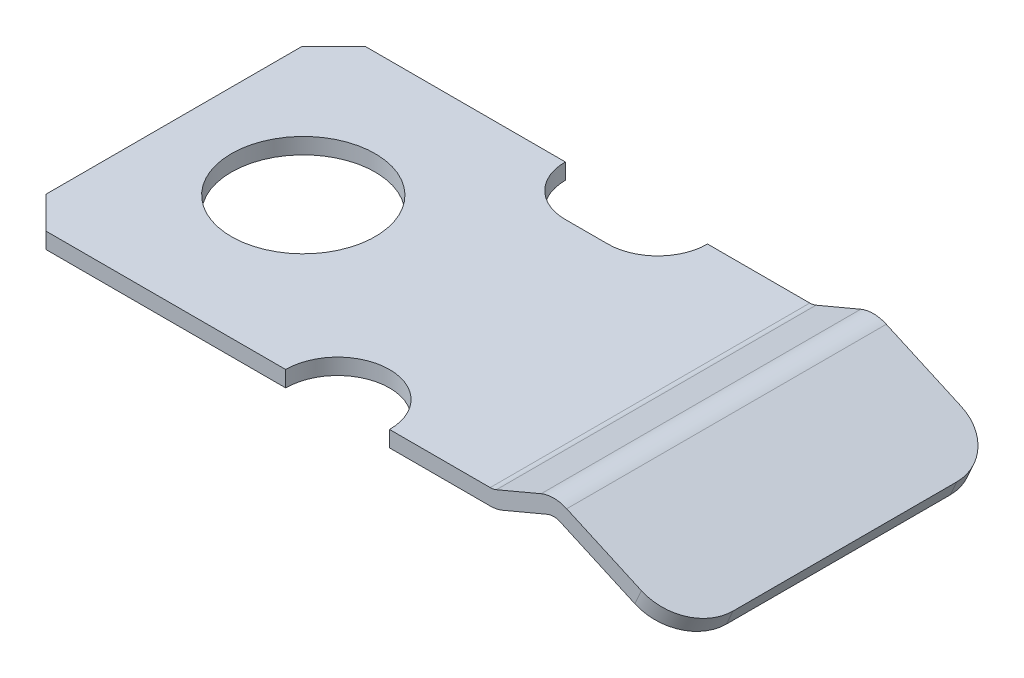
ISO-10303-21;
HEADER;
FILE_DESCRIPTION(('STEP AP214'),'2;1');
FILE_NAME('part.step','',(''),(''),'','','');
FILE_SCHEMA(('AUTOMOTIVE_DESIGN { 1 0 10303 214 1 1 1 1 }'));
ENDSEC;
DATA;
#1=APPLICATION_CONTEXT('core data for automotive mechanical design processes');
#2=APPLICATION_PROTOCOL_DEFINITION('international standard','automotive_design',2000,#1);
#3=PRODUCT_CONTEXT('',#1,'mechanical');
#4=PRODUCT('Part','Part','',(#3));
#5=PRODUCT_RELATED_PRODUCT_CATEGORY('part','',(#4));
#6=PRODUCT_DEFINITION_FORMATION('','',#4);
#7=PRODUCT_DEFINITION_CONTEXT('part definition',#1,'design');
#8=PRODUCT_DEFINITION('design','',#6,#7);
#9=PRODUCT_DEFINITION_SHAPE('','',#8);
#10=(LENGTH_UNIT() NAMED_UNIT(*) SI_UNIT(.MILLI.,.METRE.));
#11=(NAMED_UNIT(*) PLANE_ANGLE_UNIT() SI_UNIT($,.RADIAN.));
#12=(NAMED_UNIT(*) SI_UNIT($,.STERADIAN.) SOLID_ANGLE_UNIT());
#13=UNCERTAINTY_MEASURE_WITH_UNIT(LENGTH_MEASURE(1.E-05),#10,'distance_accuracy_value','');
#14=(GEOMETRIC_REPRESENTATION_CONTEXT(3) GLOBAL_UNCERTAINTY_ASSIGNED_CONTEXT((#13)) GLOBAL_UNIT_ASSIGNED_CONTEXT((#10,
#11,#12)) REPRESENTATION_CONTEXT('',''));
#15=CARTESIAN_POINT('',(0.,0.,0.));
#16=DIRECTION('',(0.,0.,1.));
#17=DIRECTION('',(1.,0.,0.));
#18=AXIS2_PLACEMENT_3D('',#15,#16,#17);
#19=CARTESIAN_POINT('',(14.8987900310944,1.,-5.));
#20=DIRECTION('',(0.,0.,1.));
#21=DIRECTION('',(1.,0.,0.));
#22=AXIS2_PLACEMENT_3D('',#19,#20,#21);
#23=PLANE('',#22);
#24=DIRECTION('',(-0.912195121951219,0.409756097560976,0.));
#25=VECTOR('',#24,1.);
#26=CARTESIAN_POINT('',(21.,-0.543902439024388,-5.));
#27=LINE('',#26,#25);
#28=CARTESIAN_POINT('',(19.6317073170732,0.0707317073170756,-5.));
#29=VERTEX_POINT('',#28);
#30=CARTESIAN_POINT('',(17.2924742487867,1.12151019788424,-5.));
#31=VERTEX_POINT('',#30);
#32=EDGE_CURVE('E321',#29,#31,#27,.T.);
#33=ORIENTED_EDGE('',*,*,#32,.F.);
#34=DIRECTION('',(0.409756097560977,0.912195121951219,0.));
#35=VECTOR('',#34,1.);
#36=CARTESIAN_POINT('',(19.1843898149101,-0.925082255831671,-5.));
#37=LINE('',#36,#35);
#38=CARTESIAN_POINT('',(19.4268292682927,-0.385365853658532,-5.));
#39=VERTEX_POINT('',#38);
#40=EDGE_CURVE('E54',#29,#39,#37,.F.);
#41=ORIENTED_EDGE('',*,*,#40,.T.);
#42=DIRECTION('',(0.912195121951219,-0.409756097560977,0.));
#43=VECTOR('',#42,1.);
#44=CARTESIAN_POINT('',(17.0875962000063,0.665412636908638,-5.));
#45=LINE('',#44,#43);
#46=CARTESIAN_POINT('',(17.0875962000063,0.665412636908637,-5.));
#47=VERTEX_POINT('',#46);
#48=EDGE_CURVE('E310',#47,#39,#45,.T.);
#49=ORIENTED_EDGE('',*,*,#48,.F.);
#50=CARTESIAN_POINT('',(16.8827181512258,0.209315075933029,-5.));
#51=DIRECTION('',(0.,0.,-1.));
#52=DIRECTION('',(-1.,0.,0.));
#53=AXIS2_PLACEMENT_3D('',#50,#51,#52);
#54=CIRCLE('',#53,0.5);
#55=CARTESIAN_POINT('',(16.688265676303,0.669954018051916,-5.));
#56=VERTEX_POINT('',#55);
#57=EDGE_CURVE('E328',#56,#47,#54,.T.);
#58=ORIENTED_EDGE('',*,*,#57,.F.);
#59=DIRECTION('',(0.921277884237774,0.388904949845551,0.));
#60=VECTOR('',#59,1.);
#61=CARTESIAN_POINT('',(15.2876949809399,0.0787221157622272,-5.));
#62=LINE('',#61,#60);
#63=CARTESIAN_POINT('',(15.2876949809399,0.0787221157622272,-5.));
#64=VERTEX_POINT('',#63);
#65=EDGE_CURVE('E352',#64,#56,#62,.T.);
#66=ORIENTED_EDGE('',*,*,#65,.F.);
#67=CARTESIAN_POINT('',(14.8987900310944,1.,-5.));
#68=DIRECTION('',(0.,0.,1.));
#69=DIRECTION('',(1.,0.,0.));
#70=AXIS2_PLACEMENT_3D('',#67,#68,#69);
#71=CIRCLE('',#70,1.);
#72=CARTESIAN_POINT('',(14.8987900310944,0.,-5.));
#73=VERTEX_POINT('',#72);
#74=EDGE_CURVE('E353',#73,#64,#71,.T.);
#75=ORIENTED_EDGE('',*,*,#74,.F.);
#76=DIRECTION('',(1.,0.,0.));
#77=VECTOR('',#76,1.);
#78=CARTESIAN_POINT('',(0.,0.,-5.));
#79=LINE('',#78,#77);
#80=CARTESIAN_POINT('',(11.7,0.,-5.));
#81=VERTEX_POINT('',#80);
#82=EDGE_CURVE('E201',#81,#73,#79,.T.);
#83=ORIENTED_EDGE('',*,*,#82,.F.);
#84=DIRECTION('',(0.,1.,0.));
#85=VECTOR('',#84,1.);
#86=CARTESIAN_POINT('',(11.7,-9.5,-5.));
#87=LINE('',#86,#85);
#88=CARTESIAN_POINT('',(11.7,0.5,-5.));
#89=VERTEX_POINT('',#88);
#90=EDGE_CURVE('E186',#81,#89,#87,.T.);
#91=ORIENTED_EDGE('',*,*,#90,.T.);
#92=DIRECTION('',(-1.,0.,0.));
#93=VECTOR('',#92,1.);
#94=CARTESIAN_POINT('',(0.,0.5,-5.));
#95=LINE('',#94,#93);
#96=CARTESIAN_POINT('',(14.8987900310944,0.499999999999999,-5.));
#97=VERTEX_POINT('',#96);
#98=EDGE_CURVE('E199',#97,#89,#95,.T.);
#99=ORIENTED_EDGE('',*,*,#98,.F.);
#100=CARTESIAN_POINT('',(14.8987900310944,1.,-5.));
#101=DIRECTION('',(0.,0.,-1.));
#102=DIRECTION('',(1.,0.,0.));
#103=AXIS2_PLACEMENT_3D('',#100,#101,#102);
#104=CIRCLE('',#103,0.500000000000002);
#105=CARTESIAN_POINT('',(15.0932425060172,0.539361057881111,-5.));
#106=VERTEX_POINT('',#105);
#107=EDGE_CURVE('E216',#106,#97,#104,.T.);
#108=ORIENTED_EDGE('',*,*,#107,.F.);
#109=DIRECTION('',(-0.921277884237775,-0.388904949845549,0.));
#110=VECTOR('',#109,1.);
#111=CARTESIAN_POINT('',(16.4938132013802,1.1305929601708,-5.));
#112=LINE('',#111,#110);
#113=CARTESIAN_POINT('',(16.4938132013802,1.1305929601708,-5.));
#114=VERTEX_POINT('',#113);
#115=EDGE_CURVE('E326',#114,#106,#112,.T.);
#116=ORIENTED_EDGE('',*,*,#115,.F.);
#117=CARTESIAN_POINT('',(16.8827181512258,0.209315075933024,-5.));
#118=DIRECTION('',(0.,0.,1.));
#119=DIRECTION('',(-1.,0.,0.));
#120=AXIS2_PLACEMENT_3D('',#117,#118,#119);
#121=CIRCLE('',#120,1.);
#122=EDGE_CURVE('E324',#31,#114,#121,.T.);
#123=ORIENTED_EDGE('',*,*,#122,.F.);
#124=EDGE_LOOP('',(#33,#41,#49,#58,#66,#75,#83,#91,#99,#108,#116,#123));
#125=FACE_BOUND('',#124,.T.);
#126=ADVANCED_FACE('F31',(#125),#23,.F.);
#127=CARTESIAN_POINT('',(14.8987900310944,1.,5.));
#128=DIRECTION('',(0.,0.,1.));
#129=DIRECTION('',(1.,0.,0.));
#130=AXIS2_PLACEMENT_3D('',#127,#128,#129);
#131=PLANE('',#130);
#132=DIRECTION('',(0.912195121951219,-0.409756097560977,0.));
#133=VECTOR('',#132,1.);
#134=CARTESIAN_POINT('',(17.0875962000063,0.665412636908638,5.));
#135=LINE('',#134,#133);
#136=CARTESIAN_POINT('',(17.0875962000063,0.665412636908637,5.));
#137=VERTEX_POINT('',#136);
#138=CARTESIAN_POINT('',(19.4268292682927,-0.385365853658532,5.));
#139=VERTEX_POINT('',#138);
#140=EDGE_CURVE('E226',#137,#139,#135,.T.);
#141=ORIENTED_EDGE('',*,*,#140,.T.);
#142=DIRECTION('',(0.409756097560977,0.912195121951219,0.));
#143=VECTOR('',#142,1.);
#144=CARTESIAN_POINT('',(19.6317073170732,0.0707317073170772,5.));
#145=LINE('',#144,#143);
#146=CARTESIAN_POINT('',(19.6317073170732,0.0707317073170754,5.));
#147=VERTEX_POINT('',#146);
#148=EDGE_CURVE('E11',#139,#147,#145,.T.);
#149=ORIENTED_EDGE('',*,*,#148,.T.);
#150=DIRECTION('',(-0.912195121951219,0.409756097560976,0.));
#151=VECTOR('',#150,1.);
#152=CARTESIAN_POINT('',(21.,-0.543902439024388,5.));
#153=LINE('',#152,#151);
#154=CARTESIAN_POINT('',(17.2924742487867,1.12151019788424,5.));
#155=VERTEX_POINT('',#154);
#156=EDGE_CURVE('E228',#147,#155,#153,.T.);
#157=ORIENTED_EDGE('',*,*,#156,.T.);
#158=CARTESIAN_POINT('',(16.8827181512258,0.209315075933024,5.));
#159=DIRECTION('',(0.,0.,1.));
#160=DIRECTION('',(-1.,0.,0.));
#161=AXIS2_PLACEMENT_3D('',#158,#159,#160);
#162=CIRCLE('',#161,1.);
#163=CARTESIAN_POINT('',(16.4938132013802,1.1305929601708,5.));
#164=VERTEX_POINT('',#163);
#165=EDGE_CURVE('E230',#155,#164,#162,.T.);
#166=ORIENTED_EDGE('',*,*,#165,.T.);
#167=DIRECTION('',(-0.921277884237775,-0.388904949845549,0.));
#168=VECTOR('',#167,1.);
#169=CARTESIAN_POINT('',(16.4938132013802,1.1305929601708,5.));
#170=LINE('',#169,#168);
#171=CARTESIAN_POINT('',(15.0932425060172,0.539361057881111,5.));
#172=VERTEX_POINT('',#171);
#173=EDGE_CURVE('E232',#164,#172,#170,.T.);
#174=ORIENTED_EDGE('',*,*,#173,.T.);
#175=CARTESIAN_POINT('',(14.8987900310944,1.,5.));
#176=DIRECTION('',(0.,0.,-1.));
#177=DIRECTION('',(1.,0.,0.));
#178=AXIS2_PLACEMENT_3D('',#175,#176,#177);
#179=CIRCLE('',#178,0.500000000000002);
#180=CARTESIAN_POINT('',(14.8987900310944,0.499999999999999,5.));
#181=VERTEX_POINT('',#180);
#182=EDGE_CURVE('E234',#172,#181,#179,.T.);
#183=ORIENTED_EDGE('',*,*,#182,.T.);
#184=DIRECTION('',(-1.,0.,0.));
#185=VECTOR('',#184,1.);
#186=CARTESIAN_POINT('',(0.,0.5,5.));
#187=LINE('',#186,#185);
#188=CARTESIAN_POINT('',(11.75,0.5,5.));
#189=VERTEX_POINT('',#188);
#190=EDGE_CURVE('E237',#181,#189,#187,.T.);
#191=ORIENTED_EDGE('',*,*,#190,.T.);
#192=DIRECTION('',(0.,1.,0.));
#193=VECTOR('',#192,1.);
#194=CARTESIAN_POINT('',(11.75,-9.5,5.));
#195=LINE('',#194,#193);
#196=CARTESIAN_POINT('',(11.75,0.,5.));
#197=VERTEX_POINT('',#196);
#198=EDGE_CURVE('E277',#197,#189,#195,.T.);
#199=ORIENTED_EDGE('',*,*,#198,.F.);
#200=DIRECTION('',(1.,0.,0.));
#201=VECTOR('',#200,1.);
#202=CARTESIAN_POINT('',(0.,0.,5.));
#203=LINE('',#202,#201);
#204=CARTESIAN_POINT('',(14.8987900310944,0.,5.));
#205=VERTEX_POINT('',#204);
#206=EDGE_CURVE('E211',#197,#205,#203,.T.);
#207=ORIENTED_EDGE('',*,*,#206,.T.);
#208=CARTESIAN_POINT('',(14.8987900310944,1.,5.));
#209=DIRECTION('',(0.,0.,1.));
#210=DIRECTION('',(1.,0.,0.));
#211=AXIS2_PLACEMENT_3D('',#208,#209,#210);
#212=CIRCLE('',#211,1.);
#213=CARTESIAN_POINT('',(15.2876949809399,0.0787221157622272,5.));
#214=VERTEX_POINT('',#213);
#215=EDGE_CURVE('E220',#205,#214,#212,.T.);
#216=ORIENTED_EDGE('',*,*,#215,.T.);
#217=DIRECTION('',(0.921277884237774,0.388904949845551,0.));
#218=VECTOR('',#217,1.);
#219=CARTESIAN_POINT('',(15.2876949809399,0.0787221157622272,5.));
#220=LINE('',#219,#218);
#221=CARTESIAN_POINT('',(16.688265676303,0.669954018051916,5.));
#222=VERTEX_POINT('',#221);
#223=EDGE_CURVE('E222',#214,#222,#220,.T.);
#224=ORIENTED_EDGE('',*,*,#223,.T.);
#225=CARTESIAN_POINT('',(16.8827181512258,0.209315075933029,5.));
#226=DIRECTION('',(0.,0.,-1.));
#227=DIRECTION('',(-1.,0.,0.));
#228=AXIS2_PLACEMENT_3D('',#225,#226,#227);
#229=CIRCLE('',#228,0.5);
#230=EDGE_CURVE('E224',#222,#137,#229,.T.);
#231=ORIENTED_EDGE('',*,*,#230,.T.);
#232=EDGE_LOOP('',(#141,#149,#157,#166,#174,#183,#191,#199,#207,#216,#224,#231));
#233=FACE_BOUND('',#232,.T.);
#234=ADVANCED_FACE('F340',(#233),#131,.T.);
#235=CARTESIAN_POINT('',(0.,0.,5.));
#236=DIRECTION('',(1.,0.,0.));
#237=DIRECTION('',(0.,0.,-1.));
#238=AXIS2_PLACEMENT_3D('',#235,#236,#237);
#239=PLANE('',#238);
#240=DIRECTION('',(0.,0.,-1.));
#241=VECTOR('',#240,1.);
#242=CARTESIAN_POINT('',(0.,0.5,5.));
#243=LINE('',#242,#241);
#244=CARTESIAN_POINT('',(0.,0.5,4.));
#245=VERTEX_POINT('',#244);
#246=CARTESIAN_POINT('',(0.,0.5,-4.));
#247=VERTEX_POINT('',#246);
#248=EDGE_CURVE('E240',#245,#247,#243,.T.);
#249=ORIENTED_EDGE('',*,*,#248,.T.);
#250=DIRECTION('',(0.,-1.,0.));
#251=VECTOR('',#250,1.);
#252=CARTESIAN_POINT('',(0.,0.,-4.));
#253=LINE('',#252,#251);
#254=CARTESIAN_POINT('',(0.,0.,-4.));
#255=VERTEX_POINT('',#254);
#256=EDGE_CURVE('E282',#247,#255,#253,.T.);
#257=ORIENTED_EDGE('',*,*,#256,.T.);
#258=DIRECTION('',(0.,0.,-1.));
#259=VECTOR('',#258,1.);
#260=CARTESIAN_POINT('',(0.,0.,5.));
#261=LINE('',#260,#259);
#262=CARTESIAN_POINT('',(0.,0.,4.));
#263=VERTEX_POINT('',#262);
#264=EDGE_CURVE('E271',#263,#255,#261,.T.);
#265=ORIENTED_EDGE('',*,*,#264,.F.);
#266=DIRECTION('',(0.,1.,0.));
#267=VECTOR('',#266,1.);
#268=CARTESIAN_POINT('',(0.,0.5,4.));
#269=LINE('',#268,#267);
#270=EDGE_CURVE('E202',#263,#245,#269,.T.);
#271=ORIENTED_EDGE('',*,*,#270,.T.);
#272=EDGE_LOOP('',(#249,#257,#265,#271));
#273=FACE_BOUND('',#272,.T.);
#274=ADVANCED_FACE('F405',(#273),#239,.F.);
#275=CARTESIAN_POINT('',(0.,0.,5.));
#276=DIRECTION('',(0.,1.,0.));
#277=DIRECTION('',(0.,0.,1.));
#278=AXIS2_PLACEMENT_3D('',#275,#276,#277);
#279=PLANE('',#278);
#280=CARTESIAN_POINT('',(4.05,0.,0.));
#281=DIRECTION('',(0.,1.,0.));
#282=DIRECTION('',(0.,0.,1.));
#283=AXIS2_PLACEMENT_3D('',#280,#281,#282);
#284=CIRCLE('',#283,2.25);
#285=CARTESIAN_POINT('',(4.05,0.,2.25));
#286=VERTEX_POINT('',#285);
#287=EDGE_CURVE('E359',#286,#286,#284,.T.);
#288=ORIENTED_EDGE('',*,*,#287,.T.);
#289=EDGE_LOOP('',(#288));
#290=FACE_BOUND('',#289,.T.);
#291=ORIENTED_EDGE('',*,*,#264,.T.);
#292=DIRECTION('',(-0.707106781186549,0.,0.707106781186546));
#293=VECTOR('',#292,1.);
#294=CARTESIAN_POINT('',(0.,0.,-4.));
#295=LINE('',#294,#293);
#296=CARTESIAN_POINT('',(1.,0.,-5.));
#297=VERTEX_POINT('',#296);
#298=EDGE_CURVE('E287',#255,#297,#295,.F.);
#299=ORIENTED_EDGE('',*,*,#298,.T.);
#300=CARTESIAN_POINT('',(7.25,0.,-5.));
#301=VERTEX_POINT('',#300);
#302=EDGE_CURVE('E357',#297,#301,#79,.T.);
#303=ORIENTED_EDGE('',*,*,#302,.T.);
#304=CARTESIAN_POINT('',(8.81,0.,-5.));
#305=DIRECTION('',(0.,1.,0.));
#306=DIRECTION('',(0.,0.,1.));
#307=AXIS2_PLACEMENT_3D('',#304,#305,#306);
#308=CIRCLE('',#307,1.56);
#309=CARTESIAN_POINT('',(8.81,0.,-3.44));
#310=VERTEX_POINT('',#309);
#311=EDGE_CURVE('E375',#301,#310,#308,.T.);
#312=ORIENTED_EDGE('',*,*,#311,.T.);
#313=DIRECTION('',(1.,0.,0.));
#314=VECTOR('',#313,1.);
#315=CARTESIAN_POINT('',(0.,0.,-3.44));
#316=LINE('',#315,#314);
#317=CARTESIAN_POINT('',(10.14,0.,-3.44));
#318=VERTEX_POINT('',#317);
#319=EDGE_CURVE('E370',#310,#318,#316,.T.);
#320=ORIENTED_EDGE('',*,*,#319,.T.);
#321=CARTESIAN_POINT('',(10.14,0.,-5.));
#322=DIRECTION('',(0.,1.,0.));
#323=DIRECTION('',(0.,0.,1.));
#324=AXIS2_PLACEMENT_3D('',#321,#322,#323);
#325=CIRCLE('',#324,1.56);
#326=EDGE_CURVE('E373',#318,#81,#325,.T.);
#327=ORIENTED_EDGE('',*,*,#326,.T.);
#328=ORIENTED_EDGE('',*,*,#82,.T.);
#329=DIRECTION('',(0.,0.,-1.));
#330=VECTOR('',#329,1.);
#331=CARTESIAN_POINT('',(14.8987900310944,0.,5.));
#332=LINE('',#331,#330);
#333=EDGE_CURVE('E268',#205,#73,#332,.T.);
#334=ORIENTED_EDGE('',*,*,#333,.F.);
#335=ORIENTED_EDGE('',*,*,#206,.F.);
#336=CARTESIAN_POINT('',(10.125,0.,5.));
#337=DIRECTION('',(0.,1.,0.));
#338=DIRECTION('',(0.,0.,1.));
#339=AXIS2_PLACEMENT_3D('',#336,#337,#338);
#340=CIRCLE('',#339,1.625);
#341=CARTESIAN_POINT('',(8.5,0.,5.));
#342=VERTEX_POINT('',#341);
#343=EDGE_CURVE('E365',#197,#342,#340,.T.);
#344=ORIENTED_EDGE('',*,*,#343,.T.);
#345=CARTESIAN_POINT('',(1.,0.,5.));
#346=VERTEX_POINT('',#345);
#347=EDGE_CURVE('E214',#346,#342,#203,.T.);
#348=ORIENTED_EDGE('',*,*,#347,.F.);
#349=DIRECTION('',(-0.707106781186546,0.,-0.707106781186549));
#350=VECTOR('',#349,1.);
#351=CARTESIAN_POINT('',(1.,0.,5.));
#352=LINE('',#351,#350);
#353=EDGE_CURVE('E285',#346,#263,#352,.T.);
#354=ORIENTED_EDGE('',*,*,#353,.T.);
#355=EDGE_LOOP('',(#291,#299,#303,#312,#320,#327,#328,#334,#335,#344,#348,#354));
#356=FACE_BOUND('',#355,.T.);
#357=ADVANCED_FACE('F393',(#290,#356),#279,.F.);
#358=CARTESIAN_POINT('',(14.8987900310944,1.,5.));
#359=DIRECTION('',(0.,0.,-1.));
#360=DIRECTION('',(-1.,0.,0.));
#361=AXIS2_PLACEMENT_3D('',#358,#359,#360);
#362=CYLINDRICAL_SURFACE('',#361,1.);
#363=ORIENTED_EDGE('',*,*,#74,.T.);
#364=DIRECTION('',(0.,0.,-1.));
#365=VECTOR('',#364,1.);
#366=CARTESIAN_POINT('',(15.2876949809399,0.0787221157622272,5.));
#367=LINE('',#366,#365);
#368=EDGE_CURVE('E265',#214,#64,#367,.T.);
#369=ORIENTED_EDGE('',*,*,#368,.F.);
#370=ORIENTED_EDGE('',*,*,#215,.F.);
#371=ORIENTED_EDGE('',*,*,#333,.T.);
#372=EDGE_LOOP('',(#363,#369,#370,#371));
#373=FACE_BOUND('',#372,.T.);
#374=ADVANCED_FACE('F425',(#373),#362,.T.);
#375=CARTESIAN_POINT('',(15.2876949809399,0.0787221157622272,5.));
#376=DIRECTION('',(-0.388904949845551,0.921277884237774,0.));
#377=DIRECTION('',(-0.921277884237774,-0.388904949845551,0.));
#378=AXIS2_PLACEMENT_3D('',#375,#376,#377);
#379=PLANE('',#378);
#380=ORIENTED_EDGE('',*,*,#65,.T.);
#381=DIRECTION('',(0.,0.,-1.));
#382=VECTOR('',#381,1.);
#383=CARTESIAN_POINT('',(16.688265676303,0.669954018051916,5.));
#384=LINE('',#383,#382);
#385=EDGE_CURVE('E262',#222,#56,#384,.T.);
#386=ORIENTED_EDGE('',*,*,#385,.F.);
#387=ORIENTED_EDGE('',*,*,#223,.F.);
#388=ORIENTED_EDGE('',*,*,#368,.T.);
#389=EDGE_LOOP('',(#380,#386,#387,#388));
#390=FACE_BOUND('',#389,.T.);
#391=ADVANCED_FACE('F429',(#390),#379,.F.);
#392=CARTESIAN_POINT('',(16.8827181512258,0.209315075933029,5.));
#393=DIRECTION('',(0.,0.,-1.));
#394=DIRECTION('',(-1.,0.,0.));
#395=AXIS2_PLACEMENT_3D('',#392,#393,#394);
#396=CYLINDRICAL_SURFACE('',#395,0.5);
#397=ORIENTED_EDGE('',*,*,#57,.T.);
#398=DIRECTION('',(0.,0.,-1.));
#399=VECTOR('',#398,1.);
#400=CARTESIAN_POINT('',(17.0875962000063,0.665412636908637,5.));
#401=LINE('',#400,#399);
#402=EDGE_CURVE('E259',#137,#47,#401,.T.);
#403=ORIENTED_EDGE('',*,*,#402,.F.);
#404=ORIENTED_EDGE('',*,*,#230,.F.);
#405=ORIENTED_EDGE('',*,*,#385,.T.);
#406=EDGE_LOOP('',(#397,#403,#404,#405));
#407=FACE_BOUND('',#406,.T.);
#408=ADVANCED_FACE('F430',(#407),#396,.F.);
#409=CARTESIAN_POINT('',(17.0875962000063,0.665412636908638,5.));
#410=DIRECTION('',(0.409756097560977,0.912195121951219,0.));
#411=DIRECTION('',(-0.912195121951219,0.409756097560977,0.));
#412=AXIS2_PLACEMENT_3D('',#409,#410,#411);
#413=PLANE('',#412);
#414=ORIENTED_EDGE('',*,*,#48,.T.);
#415=CARTESIAN_POINT('',(19.4268292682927,-0.385365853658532,-3.5));
#416=DIRECTION('',(0.409756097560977,0.912195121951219,0.));
#417=DIRECTION('',(-0.912195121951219,0.409756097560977,0.));
#418=AXIS2_PLACEMENT_3D('',#415,#416,#417);
#419=CIRCLE('',#418,1.5);
#420=CARTESIAN_POINT('',(20.7951219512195,-0.999999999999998,-3.5));
#421=VERTEX_POINT('',#420);
#422=EDGE_CURVE('E39',#39,#421,#419,.F.);
#423=ORIENTED_EDGE('',*,*,#422,.T.);
#424=DIRECTION('',(0.,0.,-1.));
#425=VECTOR('',#424,1.);
#426=CARTESIAN_POINT('',(20.7951219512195,-0.999999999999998,5.));
#427=LINE('',#426,#425);
#428=CARTESIAN_POINT('',(20.7951219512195,-0.999999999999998,3.5));
#429=VERTEX_POINT('',#428);
#430=EDGE_CURVE('E256',#429,#421,#427,.T.);
#431=ORIENTED_EDGE('',*,*,#430,.F.);
#432=CARTESIAN_POINT('',(19.4268292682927,-0.385365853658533,3.5));
#433=DIRECTION('',(0.409756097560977,0.912195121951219,0.));
#434=DIRECTION('',(-0.912195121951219,0.409756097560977,0.));
#435=AXIS2_PLACEMENT_3D('',#432,#433,#434);
#436=CIRCLE('',#435,1.5);
#437=EDGE_CURVE('E46',#429,#139,#436,.F.);
#438=ORIENTED_EDGE('',*,*,#437,.T.);
#439=ORIENTED_EDGE('',*,*,#140,.F.);
#440=ORIENTED_EDGE('',*,*,#402,.T.);
#441=EDGE_LOOP('',(#414,#423,#431,#438,#439,#440));
#442=FACE_BOUND('',#441,.T.);
#443=ADVANCED_FACE('F309',(#442),#413,.F.);
#444=CARTESIAN_POINT('',(20.7951219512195,-0.999999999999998,5.));
#445=DIRECTION('',(-0.912195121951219,0.409756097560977,0.));
#446=DIRECTION('',(-0.409756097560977,-0.912195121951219,0.));
#447=AXIS2_PLACEMENT_3D('',#444,#445,#446);
#448=PLANE('',#447);
#449=ORIENTED_EDGE('',*,*,#430,.T.);
#450=DIRECTION('',(0.409756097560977,0.912195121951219,0.));
#451=VECTOR('',#450,1.);
#452=CARTESIAN_POINT('',(20.7951219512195,-0.999999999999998,-3.5));
#453=LINE('',#452,#451);
#454=CARTESIAN_POINT('',(21.,-0.543902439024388,-3.5));
#455=VERTEX_POINT('',#454);
#456=EDGE_CURVE('E300',#421,#455,#453,.T.);
#457=ORIENTED_EDGE('',*,*,#456,.T.);
#458=DIRECTION('',(0.,0.,-1.));
#459=VECTOR('',#458,1.);
#460=CARTESIAN_POINT('',(21.,-0.543902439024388,5.));
#461=LINE('',#460,#459);
#462=CARTESIAN_POINT('',(21.,-0.543902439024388,3.5));
#463=VERTEX_POINT('',#462);
#464=EDGE_CURVE('E253',#463,#455,#461,.T.);
#465=ORIENTED_EDGE('',*,*,#464,.F.);
#466=DIRECTION('',(0.409756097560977,0.912195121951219,0.));
#467=VECTOR('',#466,1.);
#468=CARTESIAN_POINT('',(20.7951219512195,-0.999999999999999,3.5));
#469=LINE('',#468,#467);
#470=EDGE_CURVE('E298',#463,#429,#469,.F.);
#471=ORIENTED_EDGE('',*,*,#470,.T.);
#472=EDGE_LOOP('',(#449,#457,#465,#471));
#473=FACE_BOUND('',#472,.T.);
#474=ADVANCED_FACE('F314',(#473),#448,.F.);
#475=CARTESIAN_POINT('',(21.,-0.543902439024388,5.));
#476=DIRECTION('',(-0.409756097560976,-0.912195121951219,0.));
#477=DIRECTION('',(0.91219512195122,-0.409756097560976,0.));
#478=AXIS2_PLACEMENT_3D('',#475,#476,#477);
#479=PLANE('',#478);
#480=ORIENTED_EDGE('',*,*,#464,.T.);
#481=CARTESIAN_POINT('',(19.6317073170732,0.0707317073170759,-3.5));
#482=DIRECTION('',(-0.409756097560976,-0.912195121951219,0.));
#483=DIRECTION('',(0.91219512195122,-0.409756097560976,0.));
#484=AXIS2_PLACEMENT_3D('',#481,#482,#483);
#485=CIRCLE('',#484,1.5);
#486=EDGE_CURVE('E305',#455,#29,#485,.F.);
#487=ORIENTED_EDGE('',*,*,#486,.T.);
#488=ORIENTED_EDGE('',*,*,#32,.T.);
#489=DIRECTION('',(0.,0.,-1.));
#490=VECTOR('',#489,1.);
#491=CARTESIAN_POINT('',(17.2924742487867,1.12151019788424,5.));
#492=LINE('',#491,#490);
#493=EDGE_CURVE('E250',#155,#31,#492,.T.);
#494=ORIENTED_EDGE('',*,*,#493,.F.);
#495=ORIENTED_EDGE('',*,*,#156,.F.);
#496=CARTESIAN_POINT('',(19.6317073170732,0.0707317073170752,3.5));
#497=DIRECTION('',(-0.409756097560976,-0.912195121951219,0.));
#498=DIRECTION('',(0.91219512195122,-0.409756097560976,0.));
#499=AXIS2_PLACEMENT_3D('',#496,#497,#498);
#500=CIRCLE('',#499,1.5);
#501=EDGE_CURVE('E303',#147,#463,#500,.F.);
#502=ORIENTED_EDGE('',*,*,#501,.T.);
#503=EDGE_LOOP('',(#480,#487,#488,#494,#495,#502));
#504=FACE_BOUND('',#503,.T.);
#505=ADVANCED_FACE('F319',(#504),#479,.F.);
#506=CARTESIAN_POINT('',(16.8827181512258,0.209315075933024,5.));
#507=DIRECTION('',(0.,0.,-1.));
#508=DIRECTION('',(-1.,0.,0.));
#509=AXIS2_PLACEMENT_3D('',#506,#507,#508);
#510=CYLINDRICAL_SURFACE('',#509,1.);
#511=ORIENTED_EDGE('',*,*,#122,.T.);
#512=DIRECTION('',(0.,0.,-1.));
#513=VECTOR('',#512,1.);
#514=CARTESIAN_POINT('',(16.4938132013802,1.1305929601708,5.));
#515=LINE('',#514,#513);
#516=EDGE_CURVE('E247',#164,#114,#515,.T.);
#517=ORIENTED_EDGE('',*,*,#516,.F.);
#518=ORIENTED_EDGE('',*,*,#165,.F.);
#519=ORIENTED_EDGE('',*,*,#493,.T.);
#520=EDGE_LOOP('',(#511,#517,#518,#519));
#521=FACE_BOUND('',#520,.T.);
#522=ADVANCED_FACE('F344',(#521),#510,.T.);
#523=CARTESIAN_POINT('',(16.4938132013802,1.1305929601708,5.));
#524=DIRECTION('',(0.388904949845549,-0.921277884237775,0.));
#525=DIRECTION('',(0.921277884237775,0.388904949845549,0.));
#526=AXIS2_PLACEMENT_3D('',#523,#524,#525);
#527=PLANE('',#526);
#528=ORIENTED_EDGE('',*,*,#115,.T.);
#529=DIRECTION('',(0.,0.,-1.));
#530=VECTOR('',#529,1.);
#531=CARTESIAN_POINT('',(15.0932425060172,0.539361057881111,5.));
#532=LINE('',#531,#530);
#533=EDGE_CURVE('E244',#172,#106,#532,.T.);
#534=ORIENTED_EDGE('',*,*,#533,.F.);
#535=ORIENTED_EDGE('',*,*,#173,.F.);
#536=ORIENTED_EDGE('',*,*,#516,.T.);
#537=EDGE_LOOP('',(#528,#534,#535,#536));
#538=FACE_BOUND('',#537,.T.);
#539=ADVANCED_FACE('F337',(#538),#527,.F.);
#540=CARTESIAN_POINT('',(14.8987900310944,1.,5.));
#541=DIRECTION('',(0.,0.,-1.));
#542=DIRECTION('',(-1.,0.,0.));
#543=AXIS2_PLACEMENT_3D('',#540,#541,#542);
#544=CYLINDRICAL_SURFACE('',#543,0.500000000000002);
#545=ORIENTED_EDGE('',*,*,#107,.T.);
#546=DIRECTION('',(0.,0.,-1.));
#547=VECTOR('',#546,1.);
#548=CARTESIAN_POINT('',(14.8987900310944,0.499999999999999,5.));
#549=LINE('',#548,#547);
#550=EDGE_CURVE('E210',#181,#97,#549,.T.);
#551=ORIENTED_EDGE('',*,*,#550,.F.);
#552=ORIENTED_EDGE('',*,*,#182,.F.);
#553=ORIENTED_EDGE('',*,*,#533,.T.);
#554=EDGE_LOOP('',(#545,#551,#552,#553));
#555=FACE_BOUND('',#554,.T.);
#556=ADVANCED_FACE('F334',(#555),#544,.F.);
#557=CARTESIAN_POINT('',(0.,0.5,5.));
#558=DIRECTION('',(0.,-1.,0.));
#559=DIRECTION('',(1.,0.,0.));
#560=AXIS2_PLACEMENT_3D('',#557,#558,#559);
#561=PLANE('',#560);
#562=CARTESIAN_POINT('',(4.05,0.5,0.));
#563=DIRECTION('',(0.,1.,0.));
#564=DIRECTION('',(-1.,0.,0.));
#565=AXIS2_PLACEMENT_3D('',#562,#563,#564);
#566=CIRCLE('',#565,2.25);
#567=CARTESIAN_POINT('',(1.8,0.5,0.));
#568=VERTEX_POINT('',#567);
#569=EDGE_CURVE('E362',#568,#568,#566,.T.);
#570=ORIENTED_EDGE('',*,*,#569,.F.);
#571=EDGE_LOOP('',(#570));
#572=FACE_BOUND('',#571,.T.);
#573=CARTESIAN_POINT('',(7.25,0.5,-5.));
#574=VERTEX_POINT('',#573);
#575=CARTESIAN_POINT('',(1.,0.5,-5.));
#576=VERTEX_POINT('',#575);
#577=EDGE_CURVE('E212',#574,#576,#95,.T.);
#578=ORIENTED_EDGE('',*,*,#577,.T.);
#579=DIRECTION('',(0.707106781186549,0.,-0.707106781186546));
#580=VECTOR('',#579,1.);
#581=CARTESIAN_POINT('',(0.,0.5,-4.));
#582=LINE('',#581,#580);
#583=EDGE_CURVE('E293',#576,#247,#582,.F.);
#584=ORIENTED_EDGE('',*,*,#583,.T.);
#585=ORIENTED_EDGE('',*,*,#248,.F.);
#586=DIRECTION('',(0.707106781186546,0.,0.707106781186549));
#587=VECTOR('',#586,1.);
#588=CARTESIAN_POINT('',(1.,0.5,5.));
#589=LINE('',#588,#587);
#590=CARTESIAN_POINT('',(1.,0.5,5.));
#591=VERTEX_POINT('',#590);
#592=EDGE_CURVE('E291',#245,#591,#589,.T.);
#593=ORIENTED_EDGE('',*,*,#592,.T.);
#594=CARTESIAN_POINT('',(8.5,0.5,5.));
#595=VERTEX_POINT('',#594);
#596=EDGE_CURVE('E236',#595,#591,#187,.T.);
#597=ORIENTED_EDGE('',*,*,#596,.F.);
#598=CARTESIAN_POINT('',(10.125,0.5,5.));
#599=DIRECTION('',(0.,1.,0.));
#600=DIRECTION('',(-1.,0.,0.));
#601=AXIS2_PLACEMENT_3D('',#598,#599,#600);
#602=CIRCLE('',#601,1.625);
#603=EDGE_CURVE('E368',#189,#595,#602,.T.);
#604=ORIENTED_EDGE('',*,*,#603,.F.);
#605=ORIENTED_EDGE('',*,*,#190,.F.);
#606=ORIENTED_EDGE('',*,*,#550,.T.);
#607=ORIENTED_EDGE('',*,*,#98,.T.);
#608=CARTESIAN_POINT('',(10.14,0.5,-5.));
#609=DIRECTION('',(0.,1.,0.));
#610=DIRECTION('',(-1.,0.,0.));
#611=AXIS2_PLACEMENT_3D('',#608,#609,#610);
#612=CIRCLE('',#611,1.56);
#613=CARTESIAN_POINT('',(10.14,0.5,-3.44));
#614=VERTEX_POINT('',#613);
#615=EDGE_CURVE('E183',#614,#89,#612,.T.);
#616=ORIENTED_EDGE('',*,*,#615,.F.);
#617=DIRECTION('',(1.,0.,0.));
#618=VECTOR('',#617,1.);
#619=CARTESIAN_POINT('',(10.14,0.5,-3.44));
#620=LINE('',#619,#618);
#621=CARTESIAN_POINT('',(8.81,0.5,-3.44));
#622=VERTEX_POINT('',#621);
#623=EDGE_CURVE('E380',#622,#614,#620,.T.);
#624=ORIENTED_EDGE('',*,*,#623,.F.);
#625=CARTESIAN_POINT('',(8.81,0.5,-5.));
#626=DIRECTION('',(0.,1.,0.));
#627=DIRECTION('',(-1.,0.,0.));
#628=AXIS2_PLACEMENT_3D('',#625,#626,#627);
#629=CIRCLE('',#628,1.56);
#630=EDGE_CURVE('E194',#574,#622,#629,.T.);
#631=ORIENTED_EDGE('',*,*,#630,.F.);
#632=EDGE_LOOP('',(#578,#584,#585,#593,#597,#604,#605,#606,#607,#616,#624,#631));
#633=FACE_BOUND('',#632,.T.);
#634=ADVANCED_FACE('F207',(#572,#633),#561,.F.);
#635=ORIENTED_EDGE('',*,*,#596,.T.);
#636=DIRECTION('',(0.,-1.,0.));
#637=VECTOR('',#636,1.);
#638=CARTESIAN_POINT('',(1.,0.,5.));
#639=LINE('',#638,#637);
#640=EDGE_CURVE('E295',#591,#346,#639,.T.);
#641=ORIENTED_EDGE('',*,*,#640,.T.);
#642=ORIENTED_EDGE('',*,*,#347,.T.);
#643=DIRECTION('',(0.,1.,0.));
#644=VECTOR('',#643,1.);
#645=CARTESIAN_POINT('',(8.5,-9.5,5.));
#646=LINE('',#645,#644);
#647=EDGE_CURVE('E274',#595,#342,#646,.F.);
#648=ORIENTED_EDGE('',*,*,#647,.F.);
#649=EDGE_LOOP('',(#635,#641,#642,#648));
#650=FACE_BOUND('',#649,.T.);
#651=ADVANCED_FACE('F414',(#650),#131,.T.);
#652=ORIENTED_EDGE('',*,*,#302,.F.);
#653=DIRECTION('',(0.,1.,0.));
#654=VECTOR('',#653,1.);
#655=CARTESIAN_POINT('',(1.,1.,-5.));
#656=LINE('',#655,#654);
#657=EDGE_CURVE('E289',#297,#576,#656,.T.);
#658=ORIENTED_EDGE('',*,*,#657,.T.);
#659=ORIENTED_EDGE('',*,*,#577,.F.);
#660=DIRECTION('',(0.,1.,0.));
#661=VECTOR('',#660,1.);
#662=CARTESIAN_POINT('',(7.25,-9.5,-5.));
#663=LINE('',#662,#661);
#664=EDGE_CURVE('E203',#574,#301,#663,.F.);
#665=ORIENTED_EDGE('',*,*,#664,.T.);
#666=EDGE_LOOP('',(#652,#658,#659,#665));
#667=FACE_BOUND('',#666,.T.);
#668=ADVANCED_FACE('F396',(#667),#23,.F.);
#669=CARTESIAN_POINT('',(4.05,-9.5,0.));
#670=DIRECTION('',(0.,1.,0.));
#671=DIRECTION('',(-1.,0.,0.));
#672=AXIS2_PLACEMENT_3D('',#669,#670,#671);
#673=CYLINDRICAL_SURFACE('',#672,2.25);
#674=ORIENTED_EDGE('',*,*,#569,.T.);
#675=EDGE_LOOP('',(#674));
#676=FACE_BOUND('',#675,.T.);
#677=ORIENTED_EDGE('',*,*,#287,.F.);
#678=EDGE_LOOP('',(#677));
#679=FACE_BOUND('',#678,.T.);
#680=ADVANCED_FACE('F447',(#676,#679),#673,.F.);
#681=CARTESIAN_POINT('',(10.125,-9.5,5.));
#682=DIRECTION('',(0.,1.,0.));
#683=DIRECTION('',(-1.,0.,0.));
#684=AXIS2_PLACEMENT_3D('',#681,#682,#683);
#685=CYLINDRICAL_SURFACE('',#684,1.625);
#686=ORIENTED_EDGE('',*,*,#198,.T.);
#687=ORIENTED_EDGE('',*,*,#603,.T.);
#688=ORIENTED_EDGE('',*,*,#647,.T.);
#689=ORIENTED_EDGE('',*,*,#343,.F.);
#690=EDGE_LOOP('',(#686,#687,#688,#689));
#691=FACE_BOUND('',#690,.T.);
#692=ADVANCED_FACE('F452',(#691),#685,.F.);
#693=CARTESIAN_POINT('',(10.14,-9.5,-3.44));
#694=DIRECTION('',(0.,0.,1.));
#695=DIRECTION('',(1.,0.,0.));
#696=AXIS2_PLACEMENT_3D('',#693,#694,#695);
#697=PLANE('',#696);
#698=DIRECTION('',(0.,1.,0.));
#699=VECTOR('',#698,1.);
#700=CARTESIAN_POINT('',(8.81,-9.5,-3.44));
#701=LINE('',#700,#699);
#702=EDGE_CURVE('E378',#310,#622,#701,.T.);
#703=ORIENTED_EDGE('',*,*,#702,.T.);
#704=ORIENTED_EDGE('',*,*,#623,.T.);
#705=DIRECTION('',(0.,1.,0.));
#706=VECTOR('',#705,1.);
#707=CARTESIAN_POINT('',(10.14,-9.5,-3.44));
#708=LINE('',#707,#706);
#709=EDGE_CURVE('E189',#318,#614,#708,.T.);
#710=ORIENTED_EDGE('',*,*,#709,.F.);
#711=ORIENTED_EDGE('',*,*,#319,.F.);
#712=EDGE_LOOP('',(#703,#704,#710,#711));
#713=FACE_BOUND('',#712,.T.);
#714=ADVANCED_FACE('F391',(#713),#697,.F.);
#715=CARTESIAN_POINT('',(10.14,-9.5,-5.));
#716=DIRECTION('',(0.,1.,0.));
#717=DIRECTION('',(-1.,0.,0.));
#718=AXIS2_PLACEMENT_3D('',#715,#716,#717);
#719=CYLINDRICAL_SURFACE('',#718,1.56);
#720=ORIENTED_EDGE('',*,*,#709,.T.);
#721=ORIENTED_EDGE('',*,*,#615,.T.);
#722=ORIENTED_EDGE('',*,*,#90,.F.);
#723=ORIENTED_EDGE('',*,*,#326,.F.);
#724=EDGE_LOOP('',(#720,#721,#722,#723));
#725=FACE_BOUND('',#724,.T.);
#726=ADVANCED_FACE('F185',(#725),#719,.F.);
#727=CARTESIAN_POINT('',(8.81,-9.5,-5.));
#728=DIRECTION('',(0.,1.,0.));
#729=DIRECTION('',(-1.,0.,0.));
#730=AXIS2_PLACEMENT_3D('',#727,#728,#729);
#731=CYLINDRICAL_SURFACE('',#730,1.56);
#732=ORIENTED_EDGE('',*,*,#664,.F.);
#733=ORIENTED_EDGE('',*,*,#630,.T.);
#734=ORIENTED_EDGE('',*,*,#702,.F.);
#735=ORIENTED_EDGE('',*,*,#311,.F.);
#736=EDGE_LOOP('',(#732,#733,#734,#735));
#737=FACE_BOUND('',#736,.T.);
#738=ADVANCED_FACE('F387',(#737),#731,.F.);
#739=CARTESIAN_POINT('',(0.,0.,-4.));
#740=DIRECTION('',(0.707106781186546,0.,0.707106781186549));
#741=DIRECTION('',(0.707106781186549,0.,-0.707106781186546));
#742=AXIS2_PLACEMENT_3D('',#739,#740,#741);
#743=PLANE('',#742);
#744=ORIENTED_EDGE('',*,*,#583,.F.);
#745=ORIENTED_EDGE('',*,*,#657,.F.);
#746=ORIENTED_EDGE('',*,*,#298,.F.);
#747=ORIENTED_EDGE('',*,*,#256,.F.);
#748=EDGE_LOOP('',(#744,#745,#746,#747));
#749=FACE_BOUND('',#748,.T.);
#750=ADVANCED_FACE('F402',(#749),#743,.F.);
#751=CARTESIAN_POINT('',(1.,1.,5.));
#752=DIRECTION('',(-0.707106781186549,0.,0.707106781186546));
#753=DIRECTION('',(0.707106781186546,0.,0.707106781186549));
#754=AXIS2_PLACEMENT_3D('',#751,#752,#753);
#755=PLANE('',#754);
#756=ORIENTED_EDGE('',*,*,#592,.F.);
#757=ORIENTED_EDGE('',*,*,#270,.F.);
#758=ORIENTED_EDGE('',*,*,#353,.F.);
#759=ORIENTED_EDGE('',*,*,#640,.F.);
#760=EDGE_LOOP('',(#756,#757,#758,#759));
#761=FACE_BOUND('',#760,.T.);
#762=ADVANCED_FACE('F411',(#761),#755,.T.);
#763=CARTESIAN_POINT('',(19.4268292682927,-0.385365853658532,-3.5));
#764=DIRECTION('',(0.409756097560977,0.912195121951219,0.));
#765=DIRECTION('',(-0.912195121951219,0.409756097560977,0.));
#766=AXIS2_PLACEMENT_3D('',#763,#764,#765);
#767=CYLINDRICAL_SURFACE('',#766,1.5);
#768=ORIENTED_EDGE('',*,*,#422,.F.);
#769=ORIENTED_EDGE('',*,*,#40,.F.);
#770=ORIENTED_EDGE('',*,*,#486,.F.);
#771=ORIENTED_EDGE('',*,*,#456,.F.);
#772=EDGE_LOOP('',(#768,#769,#770,#771));
#773=FACE_BOUND('',#772,.T.);
#774=ADVANCED_FACE('F317',(#773),#767,.T.);
#775=CARTESIAN_POINT('',(19.1843898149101,-0.925082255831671,3.5));
#776=DIRECTION('',(-0.409756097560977,-0.912195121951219,0.));
#777=DIRECTION('',(0.912195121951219,-0.409756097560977,0.));
#778=AXIS2_PLACEMENT_3D('',#775,#776,#777);
#779=CYLINDRICAL_SURFACE('',#778,1.5);
#780=ORIENTED_EDGE('',*,*,#437,.F.);
#781=ORIENTED_EDGE('',*,*,#470,.F.);
#782=ORIENTED_EDGE('',*,*,#501,.F.);
#783=ORIENTED_EDGE('',*,*,#148,.F.);
#784=EDGE_LOOP('',(#780,#781,#782,#783));
#785=FACE_BOUND('',#784,.T.);
#786=ADVANCED_FACE('F33',(#785),#779,.T.);
#787=CLOSED_SHELL('',(#126,#234,#274,#357,#374,#391,#408,#443,#474,#505,#522,#539,#556,#634,
#651,#668,#680,#692,#714,#726,#738,#750,#762,#774,#786));
#788=MANIFOLD_SOLID_BREP('B2',#787);
#789=ADVANCED_BREP_SHAPE_REPRESENTATION('',(#18,#788),#14);
#790=SHAPE_DEFINITION_REPRESENTATION(#9,#789);
ENDSEC;
END-ISO-10303-21;
